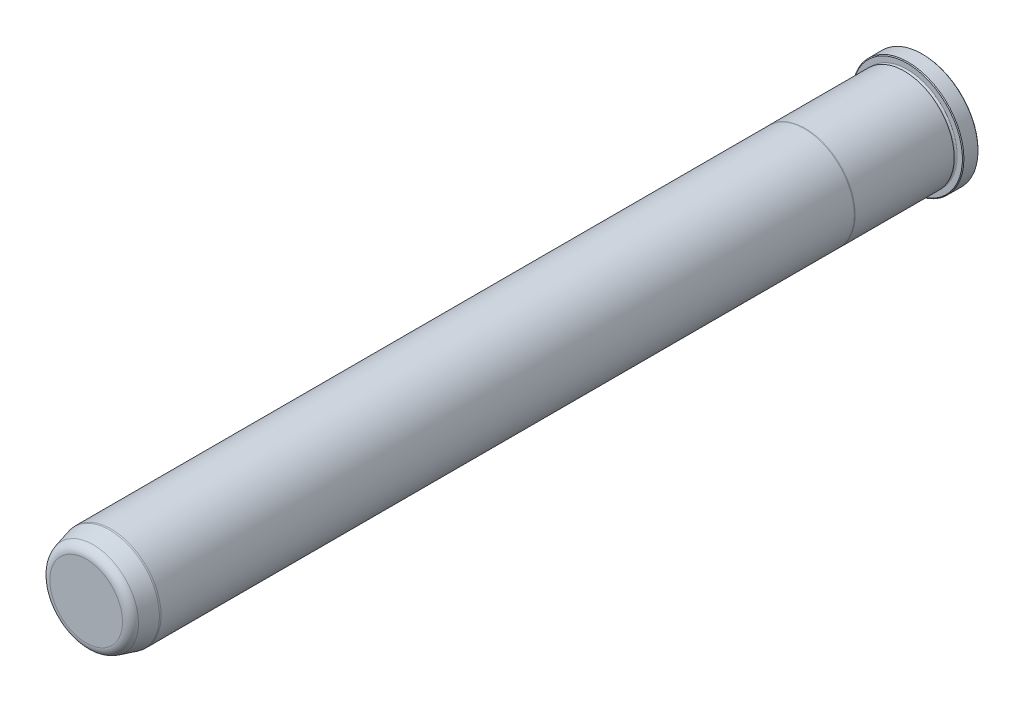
ISO-10303-21;
HEADER;
FILE_DESCRIPTION(('STEP AP214'),'2;1');
FILE_NAME('part.step','',(''),(''),'','','');
FILE_SCHEMA(('AUTOMOTIVE_DESIGN { 1 0 10303 214 1 1 1 1 }'));
ENDSEC;
DATA;
#1=APPLICATION_CONTEXT('core data for automotive mechanical design processes');
#2=APPLICATION_PROTOCOL_DEFINITION('international standard','automotive_design',2000,#1);
#3=PRODUCT_CONTEXT('',#1,'mechanical');
#4=PRODUCT('Part','Part','',(#3));
#5=PRODUCT_RELATED_PRODUCT_CATEGORY('part','',(#4));
#6=PRODUCT_DEFINITION_FORMATION('','',#4);
#7=PRODUCT_DEFINITION_CONTEXT('part definition',#1,'design');
#8=PRODUCT_DEFINITION('design','',#6,#7);
#9=PRODUCT_DEFINITION_SHAPE('','',#8);
#10=(LENGTH_UNIT() NAMED_UNIT(*) SI_UNIT(.MILLI.,.METRE.));
#11=(NAMED_UNIT(*) PLANE_ANGLE_UNIT() SI_UNIT($,.RADIAN.));
#12=(NAMED_UNIT(*) SI_UNIT($,.STERADIAN.) SOLID_ANGLE_UNIT());
#13=UNCERTAINTY_MEASURE_WITH_UNIT(LENGTH_MEASURE(1.E-05),#10,'distance_accuracy_value','');
#14=(GEOMETRIC_REPRESENTATION_CONTEXT(3) GLOBAL_UNCERTAINTY_ASSIGNED_CONTEXT((#13)) GLOBAL_UNIT_ASSIGNED_CONTEXT((#10,
#11,#12)) REPRESENTATION_CONTEXT('',''));
#15=CARTESIAN_POINT('',(0.,0.,0.));
#16=DIRECTION('',(0.,0.,1.));
#17=DIRECTION('',(1.,0.,0.));
#18=AXIS2_PLACEMENT_3D('',#15,#16,#17);
#19=CARTESIAN_POINT('',(0.,0.,0.));
#20=DIRECTION('',(0.,0.,1.));
#21=DIRECTION('',(1.,0.,0.));
#22=AXIS2_PLACEMENT_3D('',#19,#20,#21);
#23=PLANE('',#22);
#24=CARTESIAN_POINT('',(0.,0.,0.));
#25=DIRECTION('',(0.,0.,1.));
#26=DIRECTION('',(1.,0.,0.));
#27=AXIS2_PLACEMENT_3D('',#24,#25,#26);
#28=CIRCLE('',#27,28.067);
#29=CARTESIAN_POINT('',(28.067,0.,0.));
#30=VERTEX_POINT('',#29);
#31=EDGE_CURVE('E37',#30,#30,#28,.F.);
#32=ORIENTED_EDGE('',*,*,#31,.T.);
#33=EDGE_LOOP('',(#32));
#34=FACE_BOUND('',#33,.T.);
#35=ADVANCED_FACE('F30',(#34),#23,.F.);
#36=CARTESIAN_POINT('',(0.,0.,0.));
#37=DIRECTION('',(0.,0.,1.));
#38=DIRECTION('',(1.,0.,0.));
#39=AXIS2_PLACEMENT_3D('',#36,#37,#38);
#40=CYLINDRICAL_SURFACE('',#39,28.448);
#41=CARTESIAN_POINT('',(0.,0.,0.381000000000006));
#42=DIRECTION('',(0.,0.,1.));
#43=DIRECTION('',(1.,0.,0.));
#44=AXIS2_PLACEMENT_3D('',#41,#42,#43);
#45=CIRCLE('',#44,28.448);
#46=CARTESIAN_POINT('',(28.448,0.,0.381000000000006));
#47=VERTEX_POINT('',#46);
#48=EDGE_CURVE('E41',#47,#47,#45,.T.);
#49=CARTESIAN_POINT('',(0.,0.,7.54379999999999));
#50=DIRECTION('',(0.,0.,-1.));
#51=DIRECTION('',(-1.,0.,0.));
#52=AXIS2_PLACEMENT_3D('',#49,#50,#51);
#53=CIRCLE('',#52,28.448);
#54=CARTESIAN_POINT('',(28.448,0.,7.54379999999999));
#55=VERTEX_POINT('',#54);
#56=EDGE_CURVE('E45',#55,#55,#53,.T.);
#57=CARTESIAN_POINT('',(28.448,0.,0.381000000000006));
#58=CARTESIAN_POINT('',(28.448,0.,0.455612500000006));
#59=CARTESIAN_POINT('',(28.448,0.,0.530225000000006));
#60=CARTESIAN_POINT('',(28.448,0.,0.679450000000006));
#61=CARTESIAN_POINT('',(28.448,0.,0.754062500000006));
#62=CARTESIAN_POINT('',(28.448,0.,0.903287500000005));
#63=CARTESIAN_POINT('',(28.448,0.,0.977900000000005));
#64=CARTESIAN_POINT('',(28.448,0.,1.12712500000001));
#65=CARTESIAN_POINT('',(28.448,0.,1.2017375));
#66=CARTESIAN_POINT('',(28.448,0.,1.3509625));
#67=CARTESIAN_POINT('',(28.448,0.,1.425575));
#68=CARTESIAN_POINT('',(28.448,0.,1.5748));
#69=CARTESIAN_POINT('',(28.448,0.,1.6494125));
#70=CARTESIAN_POINT('',(28.448,0.,1.7986375));
#71=CARTESIAN_POINT('',(28.448,0.,1.87325));
#72=CARTESIAN_POINT('',(28.448,0.,2.022475));
#73=CARTESIAN_POINT('',(28.448,0.,2.0970875));
#74=CARTESIAN_POINT('',(28.448,0.,2.2463125));
#75=CARTESIAN_POINT('',(28.448,0.,2.320925));
#76=CARTESIAN_POINT('',(28.448,0.,2.47015));
#77=CARTESIAN_POINT('',(28.448,0.,2.5447625));
#78=CARTESIAN_POINT('',(28.448,0.,2.6939875));
#79=CARTESIAN_POINT('',(28.448,0.,2.7686));
#80=CARTESIAN_POINT('',(28.448,0.,2.917825));
#81=CARTESIAN_POINT('',(28.448,0.,2.9924375));
#82=CARTESIAN_POINT('',(28.448,0.,3.1416625));
#83=CARTESIAN_POINT('',(28.448,0.,3.216275));
#84=CARTESIAN_POINT('',(28.448,0.,3.3655));
#85=CARTESIAN_POINT('',(28.448,0.,3.4401125));
#86=CARTESIAN_POINT('',(28.448,0.,3.5893375));
#87=CARTESIAN_POINT('',(28.448,0.,3.66395));
#88=CARTESIAN_POINT('',(28.448,0.,3.813175));
#89=CARTESIAN_POINT('',(28.448,0.,3.8877875));
#90=CARTESIAN_POINT('',(28.448,0.,4.0370125));
#91=CARTESIAN_POINT('',(28.448,0.,4.111625));
#92=CARTESIAN_POINT('',(28.448,0.,4.26085));
#93=CARTESIAN_POINT('',(28.448,0.,4.3354625));
#94=CARTESIAN_POINT('',(28.448,0.,4.4846875));
#95=CARTESIAN_POINT('',(28.448,0.,4.5593));
#96=CARTESIAN_POINT('',(28.448,0.,4.708525));
#97=CARTESIAN_POINT('',(28.448,0.,4.7831375));
#98=CARTESIAN_POINT('',(28.448,0.,4.9323625));
#99=CARTESIAN_POINT('',(28.448,0.,5.006975));
#100=CARTESIAN_POINT('',(28.448,0.,5.1562));
#101=CARTESIAN_POINT('',(28.448,0.,5.2308125));
#102=CARTESIAN_POINT('',(28.448,0.,5.3800375));
#103=CARTESIAN_POINT('',(28.448,0.,5.45465));
#104=CARTESIAN_POINT('',(28.448,0.,5.603875));
#105=CARTESIAN_POINT('',(28.448,0.,5.6784875));
#106=CARTESIAN_POINT('',(28.448,0.,5.8277125));
#107=CARTESIAN_POINT('',(28.448,0.,5.902325));
#108=CARTESIAN_POINT('',(28.448,0.,6.05155));
#109=CARTESIAN_POINT('',(28.448,0.,6.1261625));
#110=CARTESIAN_POINT('',(28.448,0.,6.27538749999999));
#111=CARTESIAN_POINT('',(28.448,0.,6.35));
#112=CARTESIAN_POINT('',(28.448,0.,6.49922499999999));
#113=CARTESIAN_POINT('',(28.448,0.,6.5738375));
#114=CARTESIAN_POINT('',(28.448,0.,6.72306249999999));
#115=CARTESIAN_POINT('',(28.448,0.,6.79767499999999));
#116=CARTESIAN_POINT('',(28.448,0.,6.94689999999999));
#117=CARTESIAN_POINT('',(28.448,0.,7.02151249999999));
#118=CARTESIAN_POINT('',(28.448,0.,7.17073749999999));
#119=CARTESIAN_POINT('',(28.448,0.,7.24534999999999));
#120=CARTESIAN_POINT('',(28.448,0.,7.39457499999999));
#121=CARTESIAN_POINT('',(28.448,0.,7.46918749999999));
#122=CARTESIAN_POINT('',(28.448,0.,7.54379999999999));
#123=B_SPLINE_CURVE_WITH_KNOTS('',3,(#57,#58,#59,#60,#61,#62,#63,#64,#65,#66,#67,#68,#69,#70,
#71,#72,#73,#74,#75,#76,#77,#78,#79,#80,#81,#82,#83,#84,#85,#86,#87,#88,#89,#90,#91,#92,#93,#94,
#95,#96,#97,#98,#99,#100,#101,#102,#103,#104,#105,#106,#107,#108,#109,#110,#111,#112,#113,#114,
#115,#116,#117,#118,#119,#120,#121,#122),.UNSPECIFIED.,.F.,.F.,(4,2,2,2,2,2,2,2,2,2,2,2,2,2,2,2,
2,2,2,2,2,2,2,2,2,2,2,2,2,2,2,2,4),(0.,0.2238375,0.447674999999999,0.671512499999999,
0.895349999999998,1.1191875,1.343025,1.5668625,1.7907,2.0145375,2.238375,2.4622125,
2.68604999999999,2.90988749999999,3.13372499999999,3.35756249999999,3.58139999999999,
3.80523749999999,4.02907499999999,4.25291249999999,4.47674999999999,4.70058749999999,
4.92442499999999,5.14826249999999,5.37209999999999,5.59593749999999,5.81977499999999,
6.04361249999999,6.26744999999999,6.49128749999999,6.71512499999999,6.93896249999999,
7.16279999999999),.UNSPECIFIED.);
#124=EDGE_CURVE('BSEAM118',#47,#55,#123,.T.);
#125=ORIENTED_EDGE('',*,*,#48,.T.);
#126=ORIENTED_EDGE('',*,*,#56,.T.);
#127=ORIENTED_EDGE('',*,*,#124,.T.);
#128=ORIENTED_EDGE('',*,*,#124,.F.);
#129=EDGE_LOOP('',(#125,#127,#126,#128));
#130=FACE_BOUND('',#129,.T.);
#131=ADVANCED_FACE('F118',(#130),#40,.T.);
#132=CARTESIAN_POINT('',(0.,28.448,7.9248));
#133=DIRECTION('',(0.,0.,-1.));
#134=DIRECTION('',(-1.,0.,0.));
#135=AXIS2_PLACEMENT_3D('',#132,#133,#134);
#136=PLANE('',#135);
#137=CARTESIAN_POINT('',(0.,0.,7.9248));
#138=DIRECTION('',(0.,0.,-1.));
#139=DIRECTION('',(-1.,0.,0.));
#140=AXIS2_PLACEMENT_3D('',#137,#138,#139);
#141=CIRCLE('',#140,28.067);
#142=CARTESIAN_POINT('',(-28.067,0.,7.9248));
#143=VERTEX_POINT('',#142);
#144=EDGE_CURVE('E10',#143,#143,#141,.F.);
#145=ORIENTED_EDGE('',*,*,#144,.T.);
#146=EDGE_LOOP('',(#145));
#147=FACE_BOUND('',#146,.T.);
#148=CARTESIAN_POINT('',(0.,0.,7.9248));
#149=DIRECTION('',(0.,0.,1.));
#150=DIRECTION('',(1.,0.,0.));
#151=AXIS2_PLACEMENT_3D('',#148,#149,#150);
#152=CIRCLE('',#151,25.3873);
#153=CARTESIAN_POINT('',(25.3873,0.,7.9248));
#154=VERTEX_POINT('',#153);
#155=EDGE_CURVE('E56',#154,#154,#152,.T.);
#156=ORIENTED_EDGE('',*,*,#155,.F.);
#157=EDGE_LOOP('',(#156));
#158=FACE_BOUND('',#157,.T.);
#159=ADVANCED_FACE('F113',(#147,#158),#136,.F.);
#160=CARTESIAN_POINT('',(0.,0.,8.6868));
#161=DIRECTION('',(0.,0.,1.));
#162=DIRECTION('',(1.,0.,0.));
#163=AXIS2_PLACEMENT_3D('',#160,#161,#162);
#164=TOROIDAL_SURFACE('',#163,25.3873,0.761999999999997);
#165=CARTESIAN_POINT('',(0.,0.,9.44879999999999));
#166=DIRECTION('',(0.,0.,1.));
#167=DIRECTION('',(1.,0.,0.));
#168=AXIS2_PLACEMENT_3D('',#165,#166,#167);
#169=CIRCLE('',#168,25.3873);
#170=CARTESIAN_POINT('',(25.3873,0.,9.44879999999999));
#171=VERTEX_POINT('',#170);
#172=EDGE_CURVE('E59',#171,#171,#169,.T.);
#173=ORIENTED_EDGE('',*,*,#172,.F.);
#174=EDGE_LOOP('',(#173));
#175=FACE_BOUND('',#174,.T.);
#176=ORIENTED_EDGE('',*,*,#155,.T.);
#177=EDGE_LOOP('',(#176));
#178=FACE_BOUND('',#177,.T.);
#179=ADVANCED_FACE('F107',(#175,#178),#164,.F.);
#180=CARTESIAN_POINT('',(0.,25.3873,9.44879999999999));
#181=DIRECTION('',(0.,0.,1.));
#182=DIRECTION('',(1.,0.,0.));
#183=AXIS2_PLACEMENT_3D('',#180,#181,#182);
#184=PLANE('',#183);
#185=CARTESIAN_POINT('',(0.,0.,9.4488));
#186=DIRECTION('',(0.,0.,1.));
#187=DIRECTION('',(1.,0.,0.));
#188=AXIS2_PLACEMENT_3D('',#185,#186,#187);
#189=CIRCLE('',#188,25.4127);
#190=CARTESIAN_POINT('',(25.4127,0.,9.4488));
#191=VERTEX_POINT('',#190);
#192=EDGE_CURVE('E62',#191,#191,#189,.T.);
#193=ORIENTED_EDGE('',*,*,#192,.F.);
#194=EDGE_LOOP('',(#193));
#195=FACE_BOUND('',#194,.T.);
#196=ORIENTED_EDGE('',*,*,#172,.T.);
#197=EDGE_LOOP('',(#196));
#198=FACE_BOUND('',#197,.T.);
#199=ADVANCED_FACE('F101',(#195,#198),#184,.F.);
#200=CARTESIAN_POINT('',(0.,0.,0.));
#201=DIRECTION('',(0.,0.,1.));
#202=DIRECTION('',(1.,0.,0.));
#203=AXIS2_PLACEMENT_3D('',#200,#201,#202);
#204=CYLINDRICAL_SURFACE('',#203,25.4127);
#205=CARTESIAN_POINT('',(0.,0.,59.8347630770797));
#206=DIRECTION('',(0.,0.,1.));
#207=DIRECTION('',(1.,0.,0.));
#208=AXIS2_PLACEMENT_3D('',#205,#206,#207);
#209=CIRCLE('',#208,25.4127);
#210=CARTESIAN_POINT('',(25.4127,0.,59.8347630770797));
#211=VERTEX_POINT('',#210);
#212=EDGE_CURVE('E65',#211,#211,#209,.T.);
#213=ORIENTED_EDGE('',*,*,#212,.F.);
#214=EDGE_LOOP('',(#213));
#215=FACE_BOUND('',#214,.T.);
#216=ORIENTED_EDGE('',*,*,#192,.T.);
#217=EDGE_LOOP('',(#216));
#218=FACE_BOUND('',#217,.T.);
#219=ADVANCED_FACE('F95',(#215,#218),#204,.T.);
#220=CARTESIAN_POINT('',(0.,0.,59.8347630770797));
#221=DIRECTION('',(0.,0.,-1.));
#222=DIRECTION('',(-1.,0.,0.));
#223=AXIS2_PLACEMENT_3D('',#220,#221,#222);
#224=CONICAL_SURFACE('',#223,25.4127,0.0698131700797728);
#225=CARTESIAN_POINT('',(0.,0.,60.198));
#226=DIRECTION('',(0.,0.,1.));
#227=DIRECTION('',(1.,0.,0.));
#228=AXIS2_PLACEMENT_3D('',#225,#226,#227);
#229=CIRCLE('',#228,25.3873);
#230=CARTESIAN_POINT('',(25.3873,0.,60.198));
#231=VERTEX_POINT('',#230);
#232=EDGE_CURVE('E68',#231,#231,#229,.T.);
#233=ORIENTED_EDGE('',*,*,#232,.F.);
#234=EDGE_LOOP('',(#233));
#235=FACE_BOUND('',#234,.T.);
#236=ORIENTED_EDGE('',*,*,#212,.T.);
#237=EDGE_LOOP('',(#236));
#238=FACE_BOUND('',#237,.T.);
#239=ADVANCED_FACE('F89',(#235,#238),#224,.T.);
#240=CARTESIAN_POINT('',(0.,0.,0.));
#241=DIRECTION('',(0.,0.,1.));
#242=DIRECTION('',(1.,0.,0.));
#243=AXIS2_PLACEMENT_3D('',#240,#241,#242);
#244=CYLINDRICAL_SURFACE('',#243,25.3873);
#245=CARTESIAN_POINT('',(0.,0.,412.75));
#246=DIRECTION('',(0.,0.,1.));
#247=DIRECTION('',(1.,0.,0.));
#248=AXIS2_PLACEMENT_3D('',#245,#246,#247);
#249=CIRCLE('',#248,25.3873);
#250=CARTESIAN_POINT('',(25.3873,0.,412.75));
#251=VERTEX_POINT('',#250);
#252=EDGE_CURVE('E71',#251,#251,#249,.T.);
#253=ORIENTED_EDGE('',*,*,#252,.F.);
#254=EDGE_LOOP('',(#253));
#255=FACE_BOUND('',#254,.T.);
#256=ORIENTED_EDGE('',*,*,#232,.T.);
#257=EDGE_LOOP('',(#256));
#258=FACE_BOUND('',#257,.T.);
#259=ADVANCED_FACE('F83',(#255,#258),#244,.T.);
#260=CARTESIAN_POINT('',(0.,0.,412.75));
#261=DIRECTION('',(0.,0.,-1.));
#262=DIRECTION('',(-1.,0.,0.));
#263=AXIS2_PLACEMENT_3D('',#260,#261,#262);
#264=CONICAL_SURFACE('',#263,25.3873,0.0872664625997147);
#265=CARTESIAN_POINT('',(0.,0.,413.512));
#266=DIRECTION('',(0.,0.,1.));
#267=DIRECTION('',(1.,0.,0.));
#268=AXIS2_PLACEMENT_3D('',#265,#266,#267);
#269=CIRCLE('',#268,25.3206336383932);
#270=CARTESIAN_POINT('',(25.3206336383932,0.,413.512));
#271=VERTEX_POINT('',#270);
#272=EDGE_CURVE('E74',#271,#271,#269,.T.);
#273=ORIENTED_EDGE('',*,*,#272,.F.);
#274=EDGE_LOOP('',(#273));
#275=FACE_BOUND('',#274,.T.);
#276=ORIENTED_EDGE('',*,*,#252,.T.);
#277=EDGE_LOOP('',(#276));
#278=FACE_BOUND('',#277,.T.);
#279=ADVANCED_FACE('F80',(#275,#278),#264,.T.);
#280=CARTESIAN_POINT('',(0.,0.,413.512));
#281=DIRECTION('',(0.,0.,-1.));
#282=DIRECTION('',(-1.,0.,0.));
#283=AXIS2_PLACEMENT_3D('',#280,#281,#282);
#284=CONICAL_SURFACE('',#283,25.3206336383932,0.261799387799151);
#285=CARTESIAN_POINT('',(0.,0.,421.920125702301));
#286=DIRECTION('',(0.,0.,1.));
#287=DIRECTION('',(1.,0.,0.));
#288=AXIS2_PLACEMENT_3D('',#285,#286,#287);
#289=CIRCLE('',#288,23.0676831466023);
#290=CARTESIAN_POINT('',(23.0676831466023,0.,421.920125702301));
#291=VERTEX_POINT('',#290);
#292=EDGE_CURVE('E50',#291,#291,#289,.F.);
#293=ORIENTED_EDGE('',*,*,#292,.T.);
#294=EDGE_LOOP('',(#293));
#295=FACE_BOUND('',#294,.T.);
#296=ORIENTED_EDGE('',*,*,#272,.T.);
#297=EDGE_LOOP('',(#296));
#298=FACE_BOUND('',#297,.T.);
#299=ADVANCED_FACE('F78',(#295,#298),#284,.T.);
#300=CARTESIAN_POINT('',(0.,22.1218561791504,425.45));
#301=DIRECTION('',(0.,0.,-1.));
#302=DIRECTION('',(-1.,0.,0.));
#303=AXIS2_PLACEMENT_3D('',#300,#301,#302);
#304=PLANE('',#303);
#305=CARTESIAN_POINT('',(0.,0.,425.45));
#306=DIRECTION('',(0.,0.,-1.));
#307=DIRECTION('',(-1.,0.,0.));
#308=AXIS2_PLACEMENT_3D('',#305,#306,#307);
#309=CIRCLE('',#308,18.4674613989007);
#310=CARTESIAN_POINT('',(-18.4674613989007,0.,425.45));
#311=VERTEX_POINT('',#310);
#312=EDGE_CURVE('E53',#311,#311,#309,.F.);
#313=ORIENTED_EDGE('',*,*,#312,.T.);
#314=EDGE_LOOP('',(#313));
#315=FACE_BOUND('',#314,.T.);
#316=ADVANCED_FACE('F133',(#315),#304,.F.);
#317=CARTESIAN_POINT('',(0.,0.,420.6875));
#318=DIRECTION('',(0.,0.,-1.));
#319=DIRECTION('',(-1.,0.,0.));
#320=AXIS2_PLACEMENT_3D('',#317,#318,#319);
#321=TOROIDAL_SURFACE('',#320,18.4674613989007,4.7625);
#322=ORIENTED_EDGE('',*,*,#292,.F.);
#323=EDGE_LOOP('',(#322));
#324=FACE_BOUND('',#323,.T.);
#325=ORIENTED_EDGE('',*,*,#312,.F.);
#326=EDGE_LOOP('',(#325));
#327=FACE_BOUND('',#326,.T.);
#328=ADVANCED_FACE('F130',(#324,#327),#321,.T.);
#329=CARTESIAN_POINT('',(0.,0.,0.381000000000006));
#330=DIRECTION('',(0.,0.,1.));
#331=DIRECTION('',(1.,0.,0.));
#332=AXIS2_PLACEMENT_3D('',#329,#330,#331);
#333=CONICAL_SURFACE('',#332,28.448,0.785398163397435);
#334=CARTESIAN_POINT('',(28.067,0.,0.));
#335=CARTESIAN_POINT('',(28.07096875,0.,0.00396875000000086));
#336=CARTESIAN_POINT('',(28.0749375,0.,0.00793750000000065));
#337=CARTESIAN_POINT('',(28.082875,0.,0.0158750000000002));
#338=CARTESIAN_POINT('',(28.08684375,0.,0.01984375));
#339=CARTESIAN_POINT('',(28.09478125,0.,0.0277812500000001));
#340=CARTESIAN_POINT('',(28.09875,0.,0.0317500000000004));
#341=CARTESIAN_POINT('',(28.1066875,0.,0.0396875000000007));
#342=CARTESIAN_POINT('',(28.11065625,0.,0.0436562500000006));
#343=CARTESIAN_POINT('',(28.11859375,0.,0.0515937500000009));
#344=CARTESIAN_POINT('',(28.1225625,0.,0.0555625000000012));
#345=CARTESIAN_POINT('',(28.1305,0.,0.0635000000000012));
#346=CARTESIAN_POINT('',(28.13446875,0.,0.0674687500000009));
#347=CARTESIAN_POINT('',(28.14240625,0.,0.0754062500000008));
#348=CARTESIAN_POINT('',(28.146375,0.,0.0793750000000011));
#349=CARTESIAN_POINT('',(28.1543125,0.,0.0873125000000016));
#350=CARTESIAN_POINT('',(28.15828125,0.,0.0912812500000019));
#351=CARTESIAN_POINT('',(28.16621875,0.,0.0992187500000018));
#352=CARTESIAN_POINT('',(28.1701875,0.,0.103187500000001));
#353=CARTESIAN_POINT('',(28.178125,0.,0.111125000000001));
#354=CARTESIAN_POINT('',(28.18209375,0.,0.115093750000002));
#355=CARTESIAN_POINT('',(28.19003125,0.,0.123031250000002));
#356=CARTESIAN_POINT('',(28.194,0.,0.127000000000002));
#357=CARTESIAN_POINT('',(28.2019375,0.,0.134937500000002));
#358=CARTESIAN_POINT('',(28.20590625,0.,0.138906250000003));
#359=CARTESIAN_POINT('',(28.21384375,0.,0.146843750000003));
#360=CARTESIAN_POINT('',(28.2178125,0.,0.150812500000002));
#361=CARTESIAN_POINT('',(28.22575,0.,0.158750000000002));
#362=CARTESIAN_POINT('',(28.22971875,0.,0.162718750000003));
#363=CARTESIAN_POINT('',(28.23765625,0.,0.170656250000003));
#364=CARTESIAN_POINT('',(28.241625,0.,0.174625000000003));
#365=CARTESIAN_POINT('',(28.2495625,0.,0.182562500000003));
#366=CARTESIAN_POINT('',(28.25353125,0.,0.186531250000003));
#367=CARTESIAN_POINT('',(28.26146875,0.,0.194468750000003));
#368=CARTESIAN_POINT('',(28.2654375,0.,0.198437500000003));
#369=CARTESIAN_POINT('',(28.273375,0.,0.206375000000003));
#370=CARTESIAN_POINT('',(28.27734375,0.,0.210343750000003));
#371=CARTESIAN_POINT('',(28.28528125,0.,0.218281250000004));
#372=CARTESIAN_POINT('',(28.28925,0.,0.222250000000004));
#373=CARTESIAN_POINT('',(28.2971875,0.,0.230187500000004));
#374=CARTESIAN_POINT('',(28.30115625,0.,0.234156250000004));
#375=CARTESIAN_POINT('',(28.30909375,0.,0.242093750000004));
#376=CARTESIAN_POINT('',(28.3130625,0.,0.246062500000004));
#377=CARTESIAN_POINT('',(28.321,0.,0.254000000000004));
#378=CARTESIAN_POINT('',(28.32496875,0.,0.257968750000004));
#379=CARTESIAN_POINT('',(28.33290625,0.,0.265906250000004));
#380=CARTESIAN_POINT('',(28.336875,0.,0.269875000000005));
#381=CARTESIAN_POINT('',(28.3448125,0.,0.277812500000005));
#382=CARTESIAN_POINT('',(28.34878125,0.,0.281781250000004));
#383=CARTESIAN_POINT('',(28.35671875,0.,0.289718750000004));
#384=CARTESIAN_POINT('',(28.3606875,0.,0.293687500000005));
#385=CARTESIAN_POINT('',(28.368625,0.,0.301625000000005));
#386=CARTESIAN_POINT('',(28.37259375,0.,0.305593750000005));
#387=CARTESIAN_POINT('',(28.38053125,0.,0.313531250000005));
#388=CARTESIAN_POINT('',(28.3845,0.,0.317500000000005));
#389=CARTESIAN_POINT('',(28.3924375,0.,0.325437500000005));
#390=CARTESIAN_POINT('',(28.39640625,0.,0.329406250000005));
#391=CARTESIAN_POINT('',(28.40434375,0.,0.337343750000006));
#392=CARTESIAN_POINT('',(28.4083125,0.,0.341312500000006));
#393=CARTESIAN_POINT('',(28.41625,0.,0.349250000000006));
#394=CARTESIAN_POINT('',(28.42021875,0.,0.353218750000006));
#395=CARTESIAN_POINT('',(28.42815625,0.,0.361156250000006));
#396=CARTESIAN_POINT('',(28.432125,0.,0.365125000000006));
#397=CARTESIAN_POINT('',(28.4400625,0.,0.373062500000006));
#398=CARTESIAN_POINT('',(28.44403125,0.,0.377031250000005));
#399=CARTESIAN_POINT('',(28.448,0.,0.381000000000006));
#400=B_SPLINE_CURVE_WITH_KNOTS('',3,(#334,#335,#336,#337,#338,#339,#340,#341,#342,#343,#344,
#345,#346,#347,#348,#349,#350,#351,#352,#353,#354,#355,#356,#357,#358,#359,#360,#361,#362,#363,
#364,#365,#366,#367,#368,#369,#370,#371,#372,#373,#374,#375,#376,#377,#378,#379,#380,#381,#382,
#383,#384,#385,#386,#387,#388,#389,#390,#391,#392,#393,#394,#395,#396,#397,#398,#399),
.UNSPECIFIED.,.F.,.F.,(4,2,2,2,2,2,2,2,2,2,2,2,2,2,2,2,2,2,2,2,2,2,2,2,2,2,2,2,2,2,2,2,4),(0.,
0.016837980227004,0.0336759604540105,0.0505139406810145,0.0673519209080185,0.0841899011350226,
0.101027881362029,0.117865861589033,0.134703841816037,0.151541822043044,0.168379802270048,
0.185217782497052,0.202055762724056,0.218893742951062,0.235731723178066,0.25256970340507,
0.269407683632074,0.286245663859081,0.303083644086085,0.319921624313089,0.336759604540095,
0.353597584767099,0.370435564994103,0.387273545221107,0.404111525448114,0.420949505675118,
0.437787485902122,0.454625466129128,0.471463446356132,0.488301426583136,0.50513940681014,
0.521977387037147,0.538815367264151),.UNSPECIFIED.);
#401=EDGE_CURVE('BSEAM132',#30,#47,#400,.T.);
#402=ORIENTED_EDGE('',*,*,#31,.F.);
#403=ORIENTED_EDGE('',*,*,#48,.F.);
#404=ORIENTED_EDGE('',*,*,#401,.T.);
#405=ORIENTED_EDGE('',*,*,#401,.F.);
#406=EDGE_LOOP('',(#402,#404,#403,#405));
#407=FACE_BOUND('',#406,.T.);
#408=ADVANCED_FACE('F132',(#407),#333,.T.);
#409=CARTESIAN_POINT('',(0.,0.,7.9248));
#410=DIRECTION('',(0.,0.,-1.));
#411=DIRECTION('',(-1.,0.,0.));
#412=AXIS2_PLACEMENT_3D('',#409,#410,#411);
#413=CONICAL_SURFACE('',#412,28.067,0.785398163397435);
#414=ORIENTED_EDGE('',*,*,#56,.F.);
#415=EDGE_LOOP('',(#414));
#416=FACE_BOUND('',#415,.T.);
#417=ORIENTED_EDGE('',*,*,#144,.F.);
#418=EDGE_LOOP('',(#417));
#419=FACE_BOUND('',#418,.T.);
#420=ADVANCED_FACE('F32',(#416,#419),#413,.T.);
#421=CLOSED_SHELL('',(#35,#131,#159,#179,#199,#219,#239,#259,#279,#299,#316,#328,#408,#420));
#422=MANIFOLD_SOLID_BREP('B2',#421);
#423=ADVANCED_BREP_SHAPE_REPRESENTATION('',(#18,#422),#14);
#424=SHAPE_DEFINITION_REPRESENTATION(#9,#423);
ENDSEC;
END-ISO-10303-21;
